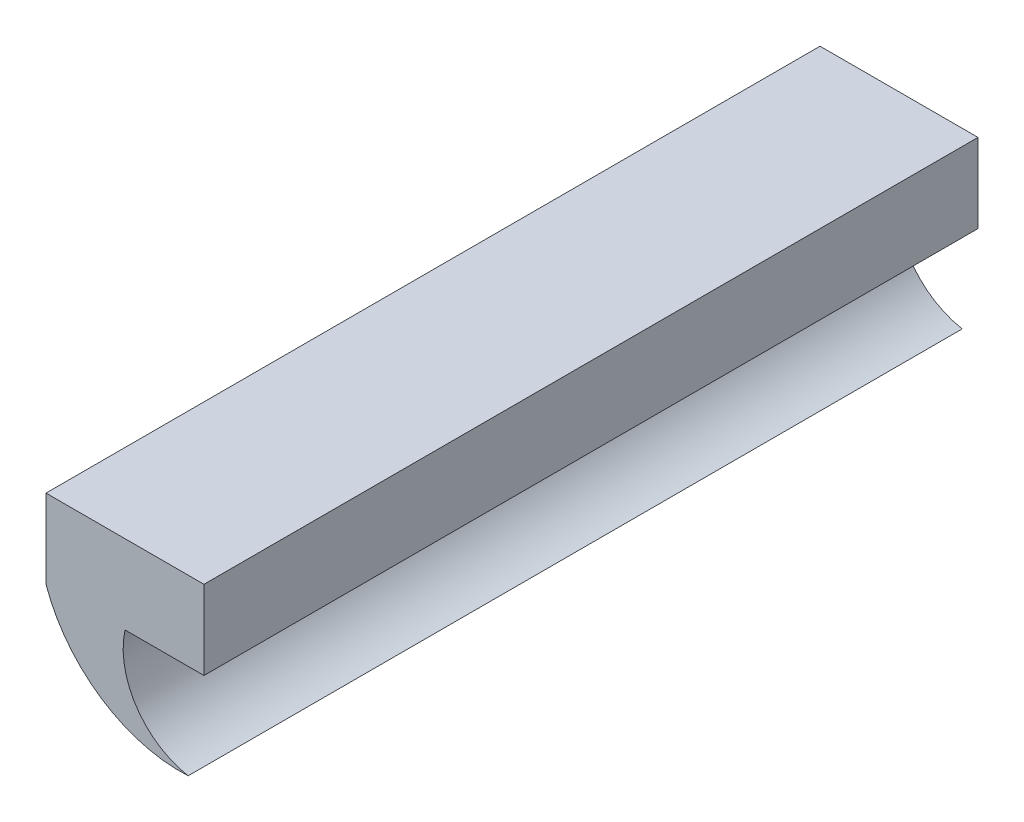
ISO-10303-21;
HEADER;
FILE_DESCRIPTION(('STEP AP214'),'2;1');
FILE_NAME('part.step','',(''),(''),'','','');
FILE_SCHEMA(('AUTOMOTIVE_DESIGN { 1 0 10303 214 1 1 1 1 }'));
ENDSEC;
DATA;
#1=APPLICATION_CONTEXT('core data for automotive mechanical design processes');
#2=APPLICATION_PROTOCOL_DEFINITION('international standard','automotive_design',2000,#1);
#3=PRODUCT_CONTEXT('',#1,'mechanical');
#4=PRODUCT('Part','Part','',(#3));
#5=PRODUCT_RELATED_PRODUCT_CATEGORY('part','',(#4));
#6=PRODUCT_DEFINITION_FORMATION('','',#4);
#7=PRODUCT_DEFINITION_CONTEXT('part definition',#1,'design');
#8=PRODUCT_DEFINITION('design','',#6,#7);
#9=PRODUCT_DEFINITION_SHAPE('','',#8);
#10=(LENGTH_UNIT() NAMED_UNIT(*) SI_UNIT(.MILLI.,.METRE.));
#11=(NAMED_UNIT(*) PLANE_ANGLE_UNIT() SI_UNIT($,.RADIAN.));
#12=(NAMED_UNIT(*) SI_UNIT($,.STERADIAN.) SOLID_ANGLE_UNIT());
#13=UNCERTAINTY_MEASURE_WITH_UNIT(LENGTH_MEASURE(1.E-05),#10,'distance_accuracy_value','');
#14=(GEOMETRIC_REPRESENTATION_CONTEXT(3) GLOBAL_UNCERTAINTY_ASSIGNED_CONTEXT((#13)) GLOBAL_UNIT_ASSIGNED_CONTEXT((#10,
#11,#12)) REPRESENTATION_CONTEXT('',''));
#15=CARTESIAN_POINT('',(0.,0.,0.));
#16=DIRECTION('',(0.,0.,1.));
#17=DIRECTION('',(1.,0.,0.));
#18=AXIS2_PLACEMENT_3D('',#15,#16,#17);
#19=CARTESIAN_POINT('',(0.,1.,9.8));
#20=DIRECTION('',(1.,0.,0.));
#21=DIRECTION('',(0.,1.,0.));
#22=AXIS2_PLACEMENT_3D('',#19,#20,#21);
#23=PLANE('',#22);
#24=DIRECTION('',(0.,-1.,0.));
#25=VECTOR('',#24,1.);
#26=CARTESIAN_POINT('',(0.,1.,0.));
#27=LINE('',#26,#25);
#28=CARTESIAN_POINT('',(0.,1.,0.));
#29=VERTEX_POINT('',#28);
#30=CARTESIAN_POINT('',(0.,0.,0.));
#31=VERTEX_POINT('',#30);
#32=EDGE_CURVE('E121',#29,#31,#27,.T.);
#33=ORIENTED_EDGE('',*,*,#32,.T.);
#34=DIRECTION('',(0.,0.,-1.));
#35=VECTOR('',#34,1.);
#36=CARTESIAN_POINT('',(0.,0.,9.8));
#37=LINE('',#36,#35);
#38=CARTESIAN_POINT('',(0.,0.,9.8));
#39=VERTEX_POINT('',#38);
#40=EDGE_CURVE('E11',#39,#31,#37,.T.);
#41=ORIENTED_EDGE('',*,*,#40,.F.);
#42=DIRECTION('',(0.,-1.,0.));
#43=VECTOR('',#42,1.);
#44=CARTESIAN_POINT('',(0.,1.,9.8));
#45=LINE('',#44,#43);
#46=CARTESIAN_POINT('',(0.,1.,9.8));
#47=VERTEX_POINT('',#46);
#48=EDGE_CURVE('E83',#47,#39,#45,.T.);
#49=ORIENTED_EDGE('',*,*,#48,.F.);
#50=DIRECTION('',(0.,0.,-1.));
#51=VECTOR('',#50,1.);
#52=CARTESIAN_POINT('',(0.,1.,9.8));
#53=LINE('',#52,#51);
#54=EDGE_CURVE('E128',#47,#29,#53,.T.);
#55=ORIENTED_EDGE('',*,*,#54,.T.);
#56=EDGE_LOOP('',(#33,#41,#49,#55));
#57=FACE_BOUND('',#56,.T.);
#58=ADVANCED_FACE('F34',(#57),#23,.F.);
#59=CARTESIAN_POINT('',(0.,0.,9.8));
#60=DIRECTION('',(0.,1.,0.));
#61=DIRECTION('',(0.,0.,1.));
#62=AXIS2_PLACEMENT_3D('',#59,#60,#61);
#63=PLANE('',#62);
#64=DIRECTION('',(1.,0.,0.));
#65=VECTOR('',#64,1.);
#66=CARTESIAN_POINT('',(0.,0.,9.8));
#67=LINE('',#66,#65);
#68=CARTESIAN_POINT('',(1.,0.,9.8));
#69=VERTEX_POINT('',#68);
#70=CARTESIAN_POINT('',(2.,0.,9.8));
#71=VERTEX_POINT('',#70);
#72=EDGE_CURVE('E48',#69,#71,#67,.T.);
#73=ORIENTED_EDGE('',*,*,#72,.F.);
#74=DIRECTION('',(0.,0.,-1.));
#75=VECTOR('',#74,1.);
#76=CARTESIAN_POINT('',(1.,0.,11.9649341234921));
#77=LINE('',#76,#75);
#78=CARTESIAN_POINT('',(1.,0.,0.));
#79=VERTEX_POINT('',#78);
#80=EDGE_CURVE('E116',#69,#79,#77,.T.);
#81=ORIENTED_EDGE('',*,*,#80,.T.);
#82=DIRECTION('',(1.,0.,0.));
#83=VECTOR('',#82,1.);
#84=CARTESIAN_POINT('',(0.,0.,0.));
#85=LINE('',#84,#83);
#86=CARTESIAN_POINT('',(2.,0.,0.));
#87=VERTEX_POINT('',#86);
#88=EDGE_CURVE('E115',#79,#87,#85,.T.);
#89=ORIENTED_EDGE('',*,*,#88,.T.);
#90=DIRECTION('',(0.,0.,-1.));
#91=VECTOR('',#90,1.);
#92=CARTESIAN_POINT('',(2.,0.,9.8));
#93=LINE('',#92,#91);
#94=EDGE_CURVE('E41',#71,#87,#93,.T.);
#95=ORIENTED_EDGE('',*,*,#94,.F.);
#96=EDGE_LOOP('',(#73,#81,#89,#95));
#97=FACE_BOUND('',#96,.T.);
#98=ADVANCED_FACE('F151',(#97),#63,.F.);
#99=CARTESIAN_POINT('',(2.,1.,9.8));
#100=DIRECTION('',(-1.,0.,0.));
#101=DIRECTION('',(0.,-1.,0.));
#102=AXIS2_PLACEMENT_3D('',#99,#100,#101);
#103=PLANE('',#102);
#104=DIRECTION('',(0.,1.,0.));
#105=VECTOR('',#104,1.);
#106=CARTESIAN_POINT('',(2.,1.,0.));
#107=LINE('',#106,#105);
#108=CARTESIAN_POINT('',(2.,1.,0.));
#109=VERTEX_POINT('',#108);
#110=EDGE_CURVE('E131',#87,#109,#107,.T.);
#111=ORIENTED_EDGE('',*,*,#110,.T.);
#112=DIRECTION('',(0.,0.,-1.));
#113=VECTOR('',#112,1.);
#114=CARTESIAN_POINT('',(2.,1.,9.8));
#115=LINE('',#114,#113);
#116=CARTESIAN_POINT('',(2.,1.,9.8));
#117=VERTEX_POINT('',#116);
#118=EDGE_CURVE('E135',#117,#109,#115,.T.);
#119=ORIENTED_EDGE('',*,*,#118,.F.);
#120=DIRECTION('',(0.,1.,0.));
#121=VECTOR('',#120,1.);
#122=CARTESIAN_POINT('',(2.,1.,9.8));
#123=LINE('',#122,#121);
#124=EDGE_CURVE('E125',#71,#117,#123,.T.);
#125=ORIENTED_EDGE('',*,*,#124,.F.);
#126=ORIENTED_EDGE('',*,*,#94,.T.);
#127=EDGE_LOOP('',(#111,#119,#125,#126));
#128=FACE_BOUND('',#127,.T.);
#129=ADVANCED_FACE('F139',(#128),#103,.F.);
#130=CARTESIAN_POINT('',(0.,1.,9.8));
#131=DIRECTION('',(0.,-1.,0.));
#132=DIRECTION('',(0.,0.,-1.));
#133=AXIS2_PLACEMENT_3D('',#130,#131,#132);
#134=PLANE('',#133);
#135=DIRECTION('',(-1.,0.,0.));
#136=VECTOR('',#135,1.);
#137=CARTESIAN_POINT('',(0.,1.,0.));
#138=LINE('',#137,#136);
#139=EDGE_CURVE('E78',#109,#29,#138,.T.);
#140=ORIENTED_EDGE('',*,*,#139,.T.);
#141=ORIENTED_EDGE('',*,*,#54,.F.);
#142=DIRECTION('',(-1.,0.,0.));
#143=VECTOR('',#142,1.);
#144=CARTESIAN_POINT('',(0.,1.,9.8));
#145=LINE('',#144,#143);
#146=EDGE_CURVE('E57',#117,#47,#145,.T.);
#147=ORIENTED_EDGE('',*,*,#146,.F.);
#148=ORIENTED_EDGE('',*,*,#118,.T.);
#149=EDGE_LOOP('',(#140,#141,#147,#148));
#150=FACE_BOUND('',#149,.T.);
#151=ADVANCED_FACE('F142',(#150),#134,.F.);
#152=CARTESIAN_POINT('',(0.,0.,9.8));
#153=DIRECTION('',(0.,0.,1.));
#154=DIRECTION('',(1.,0.,0.));
#155=AXIS2_PLACEMENT_3D('',#152,#153,#154);
#156=PLANE('',#155);
#157=ORIENTED_EDGE('',*,*,#48,.T.);
#158=CARTESIAN_POINT('',(1.69807460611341,0.597111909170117,9.8));
#159=DIRECTION('',(0.,0.,1.));
#160=DIRECTION('',(1.,0.,0.));
#161=AXIS2_PLACEMENT_3D('',#158,#159,#160);
#162=CIRCLE('',#161,1.8);
#163=CARTESIAN_POINT('',(1.8,-1.2,9.8));
#164=VERTEX_POINT('',#163);
#165=EDGE_CURVE('E105',#164,#39,#162,.F.);
#166=ORIENTED_EDGE('',*,*,#165,.F.);
#167=CARTESIAN_POINT('',(1.97646135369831,-0.215692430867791,9.8));
#168=DIRECTION('',(0.,0.,1.));
#169=DIRECTION('',(1.,0.,0.));
#170=AXIS2_PLACEMENT_3D('',#167,#168,#169);
#171=CIRCLE('',#170,1.);
#172=EDGE_CURVE('E102',#69,#164,#171,.T.);
#173=ORIENTED_EDGE('',*,*,#172,.F.);
#174=ORIENTED_EDGE('',*,*,#72,.T.);
#175=ORIENTED_EDGE('',*,*,#124,.T.);
#176=ORIENTED_EDGE('',*,*,#146,.T.);
#177=EDGE_LOOP('',(#157,#166,#173,#174,#175,#176));
#178=FACE_BOUND('',#177,.T.);
#179=ADVANCED_FACE('F144',(#178),#156,.T.);
#180=CARTESIAN_POINT('',(0.,0.,0.));
#181=DIRECTION('',(0.,0.,1.));
#182=DIRECTION('',(1.,0.,0.));
#183=AXIS2_PLACEMENT_3D('',#180,#181,#182);
#184=PLANE('',#183);
#185=ORIENTED_EDGE('',*,*,#32,.F.);
#186=ORIENTED_EDGE('',*,*,#139,.F.);
#187=ORIENTED_EDGE('',*,*,#110,.F.);
#188=ORIENTED_EDGE('',*,*,#88,.F.);
#189=CARTESIAN_POINT('',(1.97646135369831,-0.215692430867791,0.));
#190=DIRECTION('',(0.,0.,1.));
#191=DIRECTION('',(-1.,0.,0.));
#192=AXIS2_PLACEMENT_3D('',#189,#190,#191);
#193=CIRCLE('',#192,1.);
#194=CARTESIAN_POINT('',(1.8,-1.2,0.));
#195=VERTEX_POINT('',#194);
#196=EDGE_CURVE('E101',#79,#195,#193,.T.);
#197=ORIENTED_EDGE('',*,*,#196,.T.);
#198=CARTESIAN_POINT('',(1.69807460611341,0.597111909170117,0.));
#199=DIRECTION('',(0.,0.,-1.));
#200=DIRECTION('',(1.,0.,0.));
#201=AXIS2_PLACEMENT_3D('',#198,#199,#200);
#202=CIRCLE('',#201,1.8);
#203=EDGE_CURVE('E108',#195,#31,#202,.T.);
#204=ORIENTED_EDGE('',*,*,#203,.T.);
#205=EDGE_LOOP('',(#185,#186,#187,#188,#197,#204));
#206=FACE_BOUND('',#205,.T.);
#207=ADVANCED_FACE('F113',(#206),#184,.F.);
#208=CARTESIAN_POINT('',(1.97646135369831,-0.215692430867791,11.9649341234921));
#209=DIRECTION('',(0.,0.,-1.));
#210=DIRECTION('',(-1.,0.,0.));
#211=AXIS2_PLACEMENT_3D('',#208,#209,#210);
#212=CYLINDRICAL_SURFACE('',#211,1.);
#213=ORIENTED_EDGE('',*,*,#80,.F.);
#214=ORIENTED_EDGE('',*,*,#172,.T.);
#215=DIRECTION('',(0.,0.,-1.));
#216=VECTOR('',#215,1.);
#217=CARTESIAN_POINT('',(1.8,-1.2,11.9649341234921));
#218=LINE('',#217,#216);
#219=EDGE_CURVE('E96',#164,#195,#218,.T.);
#220=ORIENTED_EDGE('',*,*,#219,.T.);
#221=ORIENTED_EDGE('',*,*,#196,.F.);
#222=EDGE_LOOP('',(#213,#214,#220,#221));
#223=FACE_BOUND('',#222,.T.);
#224=ADVANCED_FACE('F99',(#223),#212,.F.);
#225=CARTESIAN_POINT('',(1.69807460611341,0.597111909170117,11.9649341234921));
#226=DIRECTION('',(0.,0.,-1.));
#227=DIRECTION('',(-1.,0.,0.));
#228=AXIS2_PLACEMENT_3D('',#225,#226,#227);
#229=CYLINDRICAL_SURFACE('',#228,1.8);
#230=ORIENTED_EDGE('',*,*,#219,.F.);
#231=ORIENTED_EDGE('',*,*,#165,.T.);
#232=ORIENTED_EDGE('',*,*,#40,.T.);
#233=ORIENTED_EDGE('',*,*,#203,.F.);
#234=EDGE_LOOP('',(#230,#231,#232,#233));
#235=FACE_BOUND('',#234,.T.);
#236=ADVANCED_FACE('F109',(#235),#229,.T.);
#237=CLOSED_SHELL('',(#58,#98,#129,#151,#179,#207,#224,#236));
#238=MANIFOLD_SOLID_BREP('B2',#237);
#239=ADVANCED_BREP_SHAPE_REPRESENTATION('',(#18,#238),#14);
#240=SHAPE_DEFINITION_REPRESENTATION(#9,#239);
ENDSEC;
END-ISO-10303-21;
